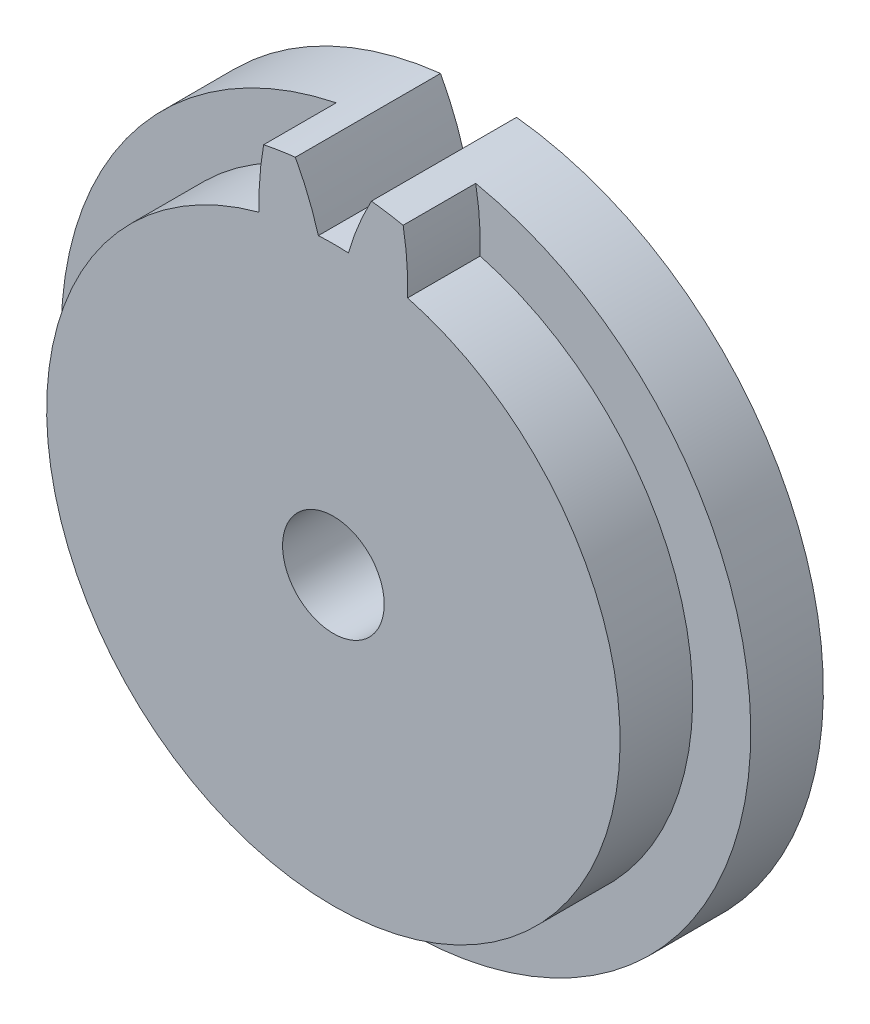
from build123d import *

# Parameters (mm, degrees)
SKETCH_1_R               = 39.5
SKETCH_1_R_2             = 7
EXTRUDE_1_DEPTH          = 10
EXTRUDE_START            = -10
SKETCH_2_R               = 7
EXTRUDE_2_DEPTH          = 10
CUT_EXTRUDE_1_DEPTH      = 10
CUT_EXTRUDE_2_DEPTH      = 84.007529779
CUT_EXTRUDE_2_DEPTH_BACK = 84.007529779
SKETCH_4_R               = 62.5
SKETCH_4_R_2             = 47.5


with BuildPart() as part:
    # Sketch 1 → Extrude 1 (new body)
    # profile 1 of 21: a face of its own
    with BuildSketch(Plane.XY):
        with Locations((0, -15.5)):
            Circle(SKETCH_1_R)
        with Locations((0, -15.5)):
            Circle(SKETCH_1_R_2, mode=Mode.SUBTRACT)
    # profile 2 of 21: a face of its own
    with BuildSketch(Plane.XY):
        with BuildLine():
            ThreePointArc((-30.697265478, 9.358155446), (-27.930717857, 12.430717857), (-24.858155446, 15.197265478))
            ThreePointArc((-24.858155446, 15.197265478), (-29.473873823, 18.291664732), (-34.474965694, 20.714316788))
            ThreePointArc((-34.474965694, 20.714316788), (-35.355339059, 19.855339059), (-36.214316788, 18.974965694))
            ThreePointArc((-36.214316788, 18.974965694), (-33.791664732, 13.973873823), (-30.697265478, 9.358155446))
        make_face()
    # profile 3 of 21: a face of its own
    with BuildSketch(Plane.XY):
        with BuildLine():
            ThreePointArc((-21.513241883, 17.627487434), (-17.93262474, 19.694757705), (-14.155534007, 21.376426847))
            ThreePointArc((-14.155534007, 21.376426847), (-17.58912109, 25.745710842), (-21.596801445, 29.595212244))
            ThreePointArc((-21.596801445, 29.595212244), (-22.699524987, 29.050326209), (-23.788511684, 28.478480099))
            ThreePointArc((-23.788511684, 28.478480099), (-23.029855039, 22.973518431), (-21.513241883, 17.627487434))
        make_face()
    # profile 4 of 21: a face of its own
    with BuildSketch(Plane.XY):
        with BuildLine():
            ThreePointArc((-10.223352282, 22.654070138), (-6.179161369, 23.513689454), (-2.067270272, 23.945866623))
            ThreePointArc((-2.067270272, 23.945866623), (-3.982622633, 29.162339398), (-6.604591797, 34.061874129))
            ThreePointArc((-6.604591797, 34.061874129), (-7.821723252, 33.88441703), (-9.034121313, 33.677074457))
            ThreePointArc((-9.034121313, 33.677074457), (-10.013722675, 28.207106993), (-10.223352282, 22.654070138))
        make_face()
    # profile 5 of 21: a face of its own
    with BuildSketch(Plane.XY):
        with BuildLine():
            ThreePointArc((2.067270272, 23.945866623), (6.179161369, 23.513689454), (10.223352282, 22.654070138))
            ThreePointArc((10.223352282, 22.654070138), (10.013722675, 28.207106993), (9.034121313, 33.677074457))
            ThreePointArc((9.034121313, 33.677074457), (7.821723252, 33.88441703), (6.604591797, 34.061874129))
            ThreePointArc((6.604591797, 34.061874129), (3.982622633, 29.162339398), (2.067270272, 23.945866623))
        make_face()
    # profile 6 of 21: a face of its own
    with BuildSketch(Plane.XY):
        with BuildLine():
            ThreePointArc((14.155534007, 21.376426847), (17.93262474, 19.694757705), (21.513241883, 17.627487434))
            ThreePointArc((21.513241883, 17.627487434), (23.029855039, 22.973518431), (23.788511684, 28.478480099))
            ThreePointArc((23.788511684, 28.478480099), (22.699524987, 29.050326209), (21.596801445, 29.595212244))
            ThreePointArc((21.596801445, 29.595212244), (17.58912109, 25.745710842), (14.155534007, 21.376426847))
        make_face()
    # profile 7 of 21: a face of its own
    with BuildSketch(Plane.XY):
        with BuildLine():
            ThreePointArc((24.858155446, 15.197265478), (27.930717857, 12.430717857), (30.697265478, 9.358155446))
            ThreePointArc((30.697265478, 9.358155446), (33.791664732, 13.973873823), (36.214316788, 18.974965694))
            ThreePointArc((36.214316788, 18.974965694), (35.355339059, 19.855339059), (34.474965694, 20.714316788))
            ThreePointArc((34.474965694, 20.714316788), (29.473873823, 18.291664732), (24.858155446, 15.197265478))
        make_face()
    # profile 8 of 21: a face of its own
    with BuildSketch(Plane.XY):
        with BuildLine():
            ThreePointArc((33.127487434, 6.013241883), (35.194757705, 2.43262474), (36.876426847, -1.344465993))
            ThreePointArc((36.876426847, -1.344465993), (41.245710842, 2.08912109), (45.095212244, 6.096801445))
            ThreePointArc((45.095212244, 6.096801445), (44.550326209, 7.199524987), (43.978480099, 8.288511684))
            ThreePointArc((43.978480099, 8.288511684), (38.473518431, 7.529855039), (33.127487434, 6.013241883))
        make_face()
    # profile 9 of 21: a face of its own
    with BuildSketch(Plane.XY):
        with BuildLine():
            ThreePointArc((38.154070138, -5.276647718), (39.013689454, -9.320838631), (39.445866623, -13.432729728))
            ThreePointArc((39.445866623, -13.432729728), (44.662339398, -11.517377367), (49.561874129, -8.895408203))
            ThreePointArc((49.561874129, -8.895408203), (49.38441703, -7.678276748), (49.177074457, -6.465878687))
            ThreePointArc((49.177074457, -6.465878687), (43.707106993, -5.486277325), (38.154070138, -5.276647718))
        make_face()
    # profile 10 of 21: a face of its own
    with BuildSketch(Plane.XY):
        with BuildLine():
            ThreePointArc((49.561874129, -22.104591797), (44.662339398, -19.482622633), (39.445866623, -17.567270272))
            ThreePointArc((39.445866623, -17.567270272), (39.013689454, -21.679161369), (38.154070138, -25.723352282))
            ThreePointArc((38.154070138, -25.723352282), (43.707106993, -25.513722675), (49.177074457, -24.534121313))
            ThreePointArc((49.177074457, -24.534121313), (49.38441703, -23.321723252), (49.561874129, -22.104591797))
        make_face()
    # profile 11 of 21: a face of its own
    with BuildSketch(Plane.XY):
        with BuildLine():
            ThreePointArc((45.095212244, -37.096801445), (41.245710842, -33.08912109), (36.876426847, -29.655534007))
            ThreePointArc((36.876426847, -29.655534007), (35.194757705, -33.43262474), (33.127487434, -37.013241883))
            ThreePointArc((33.127487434, -37.013241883), (38.473518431, -38.529855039), (43.978480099, -39.288511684))
            ThreePointArc((43.978480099, -39.288511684), (44.550326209, -38.199524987), (45.095212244, -37.096801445))
        make_face()
    # profile 12 of 21: a face of its own
    with BuildSketch(Plane.XY):
        with BuildLine():
            ThreePointArc((36.214316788, -49.974965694), (33.791664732, -44.973873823), (30.697265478, -40.358155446))
            ThreePointArc((30.697265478, -40.358155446), (27.930717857, -43.430717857), (24.858155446, -46.197265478))
            ThreePointArc((24.858155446, -46.197265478), (29.473873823, -49.291664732), (34.474965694, -51.714316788))
            ThreePointArc((34.474965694, -51.714316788), (35.355339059, -50.855339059), (36.214316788, -49.974965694))
        make_face()
    # profile 13 of 21: a face of its own
    with BuildSketch(Plane.XY):
        with BuildLine():
            ThreePointArc((23.788511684, -59.478480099), (23.029855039, -53.973518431), (21.513241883, -48.627487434))
            ThreePointArc((21.513241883, -48.627487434), (17.93262474, -50.694757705), (14.155534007, -52.376426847))
            ThreePointArc((14.155534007, -52.376426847), (17.58912109, -56.745710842), (21.596801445, -60.595212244))
            ThreePointArc((21.596801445, -60.595212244), (22.699524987, -60.050326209), (23.788511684, -59.478480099))
        make_face()
    # profile 14 of 21: a face of its own
    with BuildSketch(Plane.XY):
        with BuildLine():
            ThreePointArc((9.034121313, -64.677074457), (10.013722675, -59.207106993), (10.223352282, -53.654070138))
            ThreePointArc((10.223352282, -53.654070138), (6.179161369, -54.513689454), (2.067270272, -54.945866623))
            ThreePointArc((2.067270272, -54.945866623), (3.982622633, -60.162339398), (6.604591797, -65.061874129))
            ThreePointArc((6.604591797, -65.061874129), (7.821723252, -64.88441703), (9.034121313, -64.677074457))
        make_face()
    # profile 15 of 21: a face of its own
    with BuildSketch(Plane.XY):
        with BuildLine():
            ThreePointArc((-6.604591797, -65.061874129), (-3.982622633, -60.162339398), (-2.067270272, -54.945866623))
            ThreePointArc((-2.067270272, -54.945866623), (-6.179161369, -54.513689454), (-10.223352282, -53.654070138))
            ThreePointArc((-10.223352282, -53.654070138), (-10.013722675, -59.207106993), (-9.034121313, -64.677074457))
            ThreePointArc((-9.034121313, -64.677074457), (-7.821723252, -64.88441703), (-6.604591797, -65.061874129))
        make_face()
    # profile 16 of 21: a face of its own
    with BuildSketch(Plane.XY):
        with BuildLine():
            ThreePointArc((-21.596801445, -60.595212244), (-17.58912109, -56.745710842), (-14.155534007, -52.376426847))
            ThreePointArc((-14.155534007, -52.376426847), (-17.93262474, -50.694757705), (-21.513241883, -48.627487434))
            ThreePointArc((-21.513241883, -48.627487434), (-23.029855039, -53.973518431), (-23.788511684, -59.478480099))
            ThreePointArc((-23.788511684, -59.478480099), (-22.699524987, -60.050326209), (-21.596801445, -60.595212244))
        make_face()
    # profile 17 of 21: a face of its own
    with BuildSketch(Plane.XY):
        with BuildLine():
            ThreePointArc((-34.474965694, -51.714316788), (-29.473873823, -49.291664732), (-24.858155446, -46.197265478))
            ThreePointArc((-24.858155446, -46.197265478), (-27.930717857, -43.430717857), (-30.697265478, -40.358155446))
            ThreePointArc((-30.697265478, -40.358155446), (-33.791664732, -44.973873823), (-36.214316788, -49.974965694))
            ThreePointArc((-36.214316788, -49.974965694), (-35.355339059, -50.855339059), (-34.474965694, -51.714316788))
        make_face()
    # profile 18 of 21: a face of its own
    with BuildSketch(Plane.XY):
        with BuildLine():
            ThreePointArc((-43.978480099, -39.288511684), (-38.473518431, -38.529855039), (-33.127487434, -37.013241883))
            ThreePointArc((-33.127487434, -37.013241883), (-35.194757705, -33.43262474), (-36.876426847, -29.655534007))
            ThreePointArc((-36.876426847, -29.655534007), (-41.245710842, -33.08912109), (-45.095212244, -37.096801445))
            ThreePointArc((-45.095212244, -37.096801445), (-44.550326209, -38.199524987), (-43.978480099, -39.288511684))
        make_face()
    # profile 19 of 21: a face of its own
    with BuildSketch(Plane.XY):
        with BuildLine():
            ThreePointArc((-49.177074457, -24.534121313), (-43.707106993, -25.513722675), (-38.154070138, -25.723352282))
            ThreePointArc((-38.154070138, -25.723352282), (-39.013689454, -21.679161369), (-39.445866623, -17.567270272))
            ThreePointArc((-39.445866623, -17.567270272), (-44.662339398, -19.482622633), (-49.561874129, -22.104591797))
            ThreePointArc((-49.561874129, -22.104591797), (-49.38441703, -23.321723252), (-49.177074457, -24.534121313))
        make_face()
    # profile 20 of 21: a face of its own
    with BuildSketch(Plane.XY):
        with BuildLine():
            ThreePointArc((-39.445866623, -13.432729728), (-39.013689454, -9.320838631), (-38.154070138, -5.276647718))
            ThreePointArc((-38.154070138, -5.276647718), (-43.707106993, -5.486277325), (-49.177074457, -6.465878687))
            ThreePointArc((-49.177074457, -6.465878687), (-49.38441703, -7.678276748), (-49.561874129, -8.895408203))
            ThreePointArc((-49.561874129, -8.895408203), (-44.662339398, -11.517377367), (-39.445866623, -13.432729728))
        make_face()
    # profile 21 of 21: a face of its own
    with BuildSketch(Plane.XY):
        with BuildLine():
            ThreePointArc((-36.876426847, -1.344465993), (-35.194757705, 2.43262474), (-33.127487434, 6.013241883))
            ThreePointArc((-33.127487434, 6.013241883), (-38.473518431, 7.529855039), (-43.978480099, 8.288511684))
            ThreePointArc((-43.978480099, 8.288511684), (-44.550326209, 7.199524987), (-45.095212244, 6.096801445))
            ThreePointArc((-45.095212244, 6.096801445), (-41.245710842, 2.08912109), (-36.876426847, -1.344465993))
        make_face()
    extrude(amount=EXTRUDE_1_DEPTH)

    # Sketch 2 → Extrude 2 (add)
    with BuildSketch(Plane.XY.offset(EXTRUDE_START)):
        with BuildLine():
            ThreePointArc((6.604591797, 34.061874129), (3.982622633, 29.162339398), (2.067270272, 23.945866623))
            ThreePointArc((2.067270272, 23.945866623), (0, 24), (-2.067270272, 23.945866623))
            ThreePointArc((-2.067270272, 23.945866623), (-3.982622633, 29.162339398), (-6.604591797, 34.061874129))
            ThreePointArc((-6.604591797, 34.061874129), (0, -65.5), (6.604591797, 34.061874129))
        make_face()
        with Locations((0, -15.5)):
            Circle(SKETCH_2_R, mode=Mode.SUBTRACT)
    extrude(amount=EXTRUDE_2_DEPTH)

    # Sketch 3 → Cut-Extrude 1 (cut)
    with BuildSketch(Plane.XY):
        with BuildLine():
            ThreePointArc((14.155534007, 21.376426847), (17.93262474, 19.694757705), (21.513241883, 17.627487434))
            ThreePointArc((21.513241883, 17.627487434), (23.029855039, 22.973518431), (23.788511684, 28.478480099))
            ThreePointArc((23.788511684, 28.478480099), (22.699524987, 29.050326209), (21.596801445, 29.595212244))
            ThreePointArc((21.596801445, 29.595212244), (17.58912109, 25.745710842), (14.155534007, 21.376426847))
        make_face()
        with BuildLine():
            ThreePointArc((24.858155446, 15.197265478), (27.930717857, 12.430717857), (30.697265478, 9.358155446))
            ThreePointArc((30.697265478, 9.358155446), (33.791664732, 13.973873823), (36.214316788, 18.974965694))
            ThreePointArc((36.214316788, 18.974965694), (35.355339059, 19.855339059), (34.474965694, 20.714316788))
            ThreePointArc((34.474965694, 20.714316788), (29.473873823, 18.291664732), (24.858155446, 15.197265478))
        make_face()
        with BuildLine():
            ThreePointArc((33.127487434, 6.013241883), (35.194757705, 2.43262474), (36.876426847, -1.344465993))
            ThreePointArc((36.876426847, -1.344465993), (41.245710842, 2.08912109), (45.095212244, 6.096801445))
            ThreePointArc((45.095212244, 6.096801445), (44.550326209, 7.199524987), (43.978480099, 8.288511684))
            ThreePointArc((43.978480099, 8.288511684), (38.473518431, 7.529855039), (33.127487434, 6.013241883))
        make_face()
        with BuildLine():
            ThreePointArc((38.154070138, -5.276647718), (39.013689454, -9.320838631), (39.445866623, -13.432729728))
            ThreePointArc((39.445866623, -13.432729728), (44.662339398, -11.517377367), (49.561874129, -8.895408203))
            ThreePointArc((49.561874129, -8.895408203), (49.38441703, -7.678276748), (49.177074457, -6.465878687))
            ThreePointArc((49.177074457, -6.465878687), (43.707106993, -5.486277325), (38.154070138, -5.276647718))
        make_face()
        with BuildLine():
            ThreePointArc((49.561874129, -22.104591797), (44.662339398, -19.482622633), (39.445866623, -17.567270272))
            ThreePointArc((39.445866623, -17.567270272), (39.013689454, -21.679161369), (38.154070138, -25.723352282))
            ThreePointArc((38.154070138, -25.723352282), (43.707106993, -25.513722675), (49.177074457, -24.534121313))
            ThreePointArc((49.177074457, -24.534121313), (49.38441703, -23.321723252), (49.561874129, -22.104591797))
        make_face()
        with BuildLine():
            ThreePointArc((45.095212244, -37.096801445), (41.245710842, -33.08912109), (36.876426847, -29.655534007))
            ThreePointArc((36.876426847, -29.655534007), (35.194757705, -33.43262474), (33.127487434, -37.013241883))
            ThreePointArc((33.127487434, -37.013241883), (38.473518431, -38.529855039), (43.978480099, -39.288511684))
            ThreePointArc((43.978480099, -39.288511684), (44.550326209, -38.199524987), (45.095212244, -37.096801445))
        make_face()
        with BuildLine():
            ThreePointArc((36.214316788, -49.974965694), (33.791664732, -44.973873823), (30.697265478, -40.358155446))
            ThreePointArc((30.697265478, -40.358155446), (27.930717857, -43.430717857), (24.858155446, -46.197265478))
            ThreePointArc((24.858155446, -46.197265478), (29.473873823, -49.291664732), (34.474965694, -51.714316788))
            ThreePointArc((34.474965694, -51.714316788), (35.355339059, -50.855339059), (36.214316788, -49.974965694))
        make_face()
        with BuildLine():
            ThreePointArc((23.788511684, -59.478480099), (23.029855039, -53.973518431), (21.513241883, -48.627487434))
            ThreePointArc((21.513241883, -48.627487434), (17.93262474, -50.694757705), (14.155534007, -52.376426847))
            ThreePointArc((14.155534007, -52.376426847), (17.58912109, -56.745710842), (21.596801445, -60.595212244))
            ThreePointArc((21.596801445, -60.595212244), (22.699524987, -60.050326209), (23.788511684, -59.478480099))
        make_face()
        with BuildLine():
            ThreePointArc((9.034121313, -64.677074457), (10.013722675, -59.207106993), (10.223352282, -53.654070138))
            ThreePointArc((10.223352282, -53.654070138), (6.179161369, -54.513689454), (2.067270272, -54.945866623))
            ThreePointArc((2.067270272, -54.945866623), (3.982622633, -60.162339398), (6.604591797, -65.061874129))
            ThreePointArc((6.604591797, -65.061874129), (7.821723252, -64.88441703), (9.034121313, -64.677074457))
        make_face()
        with BuildLine():
            ThreePointArc((-6.604591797, -65.061874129), (-3.982622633, -60.162339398), (-2.067270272, -54.945866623))
            ThreePointArc((-2.067270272, -54.945866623), (-6.179161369, -54.513689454), (-10.223352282, -53.654070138))
            ThreePointArc((-10.223352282, -53.654070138), (-10.013722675, -59.207106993), (-9.034121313, -64.677074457))
            ThreePointArc((-9.034121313, -64.677074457), (-7.821723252, -64.88441703), (-6.604591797, -65.061874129))
        make_face()
        with BuildLine():
            ThreePointArc((-21.596801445, -60.595212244), (-17.58912109, -56.745710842), (-14.155534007, -52.376426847))
            ThreePointArc((-14.155534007, -52.376426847), (-17.93262474, -50.694757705), (-21.513241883, -48.627487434))
            ThreePointArc((-21.513241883, -48.627487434), (-23.029855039, -53.973518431), (-23.788511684, -59.478480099))
            ThreePointArc((-23.788511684, -59.478480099), (-22.699524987, -60.050326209), (-21.596801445, -60.595212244))
        make_face()
        with BuildLine():
            ThreePointArc((-34.474965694, -51.714316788), (-29.473873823, -49.291664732), (-24.858155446, -46.197265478))
            ThreePointArc((-24.858155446, -46.197265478), (-27.930717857, -43.430717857), (-30.697265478, -40.358155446))
            ThreePointArc((-30.697265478, -40.358155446), (-33.791664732, -44.973873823), (-36.214316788, -49.974965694))
            ThreePointArc((-36.214316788, -49.974965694), (-35.355339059, -50.855339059), (-34.474965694, -51.714316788))
        make_face()
        with BuildLine():
            ThreePointArc((-43.978480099, -39.288511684), (-38.473518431, -38.529855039), (-33.127487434, -37.013241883))
            ThreePointArc((-33.127487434, -37.013241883), (-35.194757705, -33.43262474), (-36.876426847, -29.655534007))
            ThreePointArc((-36.876426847, -29.655534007), (-41.245710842, -33.08912109), (-45.095212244, -37.096801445))
            ThreePointArc((-45.095212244, -37.096801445), (-44.550326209, -38.199524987), (-43.978480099, -39.288511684))
        make_face()
        with BuildLine():
            ThreePointArc((-49.177074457, -24.534121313), (-43.707106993, -25.513722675), (-38.154070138, -25.723352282))
            ThreePointArc((-38.154070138, -25.723352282), (-39.013689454, -21.679161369), (-39.445866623, -17.567270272))
            ThreePointArc((-39.445866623, -17.567270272), (-44.662339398, -19.482622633), (-49.561874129, -22.104591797))
            ThreePointArc((-49.561874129, -22.104591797), (-49.38441703, -23.321723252), (-49.177074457, -24.534121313))
        make_face()
        with BuildLine():
            ThreePointArc((-39.445866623, -13.432729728), (-39.013689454, -9.320838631), (-38.154070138, -5.276647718))
            ThreePointArc((-38.154070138, -5.276647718), (-43.707106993, -5.486277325), (-49.177074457, -6.465878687))
            ThreePointArc((-49.177074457, -6.465878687), (-49.38441703, -7.678276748), (-49.561874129, -8.895408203))
            ThreePointArc((-49.561874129, -8.895408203), (-44.662339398, -11.517377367), (-39.445866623, -13.432729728))
        make_face()
        with BuildLine():
            ThreePointArc((-36.876426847, -1.344465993), (-35.194757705, 2.43262474), (-33.127487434, 6.013241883))
            ThreePointArc((-33.127487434, 6.013241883), (-38.473518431, 7.529855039), (-43.978480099, 8.288511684))
            ThreePointArc((-43.978480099, 8.288511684), (-44.550326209, 7.199524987), (-45.095212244, 6.096801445))
            ThreePointArc((-45.095212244, 6.096801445), (-41.245710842, 2.08912109), (-36.876426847, -1.344465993))
        make_face()
        with BuildLine():
            ThreePointArc((-30.697265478, 9.358155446), (-27.930717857, 12.430717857), (-24.858155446, 15.197265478))
            ThreePointArc((-24.858155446, 15.197265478), (-29.473873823, 18.291664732), (-34.474965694, 20.714316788))
            ThreePointArc((-34.474965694, 20.714316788), (-35.355339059, 19.855339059), (-36.214316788, 18.974965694))
            ThreePointArc((-36.214316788, 18.974965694), (-33.791664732, 13.973873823), (-30.697265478, 9.358155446))
        make_face()
        with BuildLine():
            ThreePointArc((-21.513241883, 17.627487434), (-17.93262474, 19.694757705), (-14.155534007, 21.376426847))
            ThreePointArc((-14.155534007, 21.376426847), (-17.58912109, 25.745710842), (-21.596801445, 29.595212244))
            ThreePointArc((-21.596801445, 29.595212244), (-22.699524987, 29.050326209), (-23.788511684, 28.478480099))
            ThreePointArc((-23.788511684, 28.478480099), (-23.029855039, 22.973518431), (-21.513241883, 17.627487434))
        make_face()
    extrude(amount=CUT_EXTRUDE_1_DEPTH, mode=Mode.SUBTRACT)

    # Sketch 4 → Cut-Extrude 2 (cut, two sides: drawn at the far end of the back side and taken through both)
    with BuildSketch(Plane.XY.offset(-CUT_EXTRUDE_2_DEPTH_BACK)):
        with Locations((0, -15.5)):
            Circle(SKETCH_4_R)
        with Locations((0, -15.5)):
            Circle(SKETCH_4_R_2, mode=Mode.SUBTRACT)
    extrude(amount=CUT_EXTRUDE_2_DEPTH + CUT_EXTRUDE_2_DEPTH_BACK, mode=Mode.SUBTRACT)


solid = part.part
